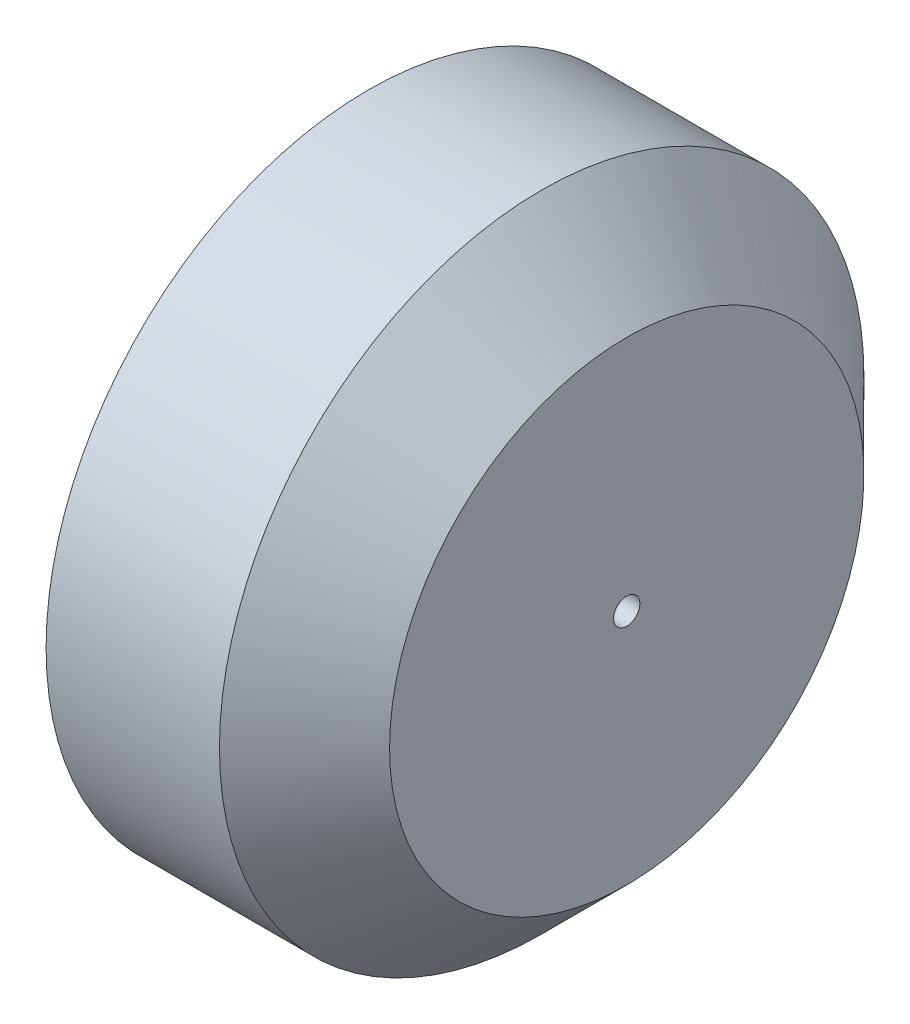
ISO-10303-21;
HEADER;
FILE_DESCRIPTION(('STEP AP214'),'2;1');
FILE_NAME('part.step','',(''),(''),'','','');
FILE_SCHEMA(('AUTOMOTIVE_DESIGN { 1 0 10303 214 1 1 1 1 }'));
ENDSEC;
DATA;
#1=APPLICATION_CONTEXT('core data for automotive mechanical design processes');
#2=APPLICATION_PROTOCOL_DEFINITION('international standard','automotive_design',2000,#1);
#3=PRODUCT_CONTEXT('',#1,'mechanical');
#4=PRODUCT('Part','Part','',(#3));
#5=PRODUCT_RELATED_PRODUCT_CATEGORY('part','',(#4));
#6=PRODUCT_DEFINITION_FORMATION('','',#4);
#7=PRODUCT_DEFINITION_CONTEXT('part definition',#1,'design');
#8=PRODUCT_DEFINITION('design','',#6,#7);
#9=PRODUCT_DEFINITION_SHAPE('','',#8);
#10=(LENGTH_UNIT() NAMED_UNIT(*) SI_UNIT(.MILLI.,.METRE.));
#11=(NAMED_UNIT(*) PLANE_ANGLE_UNIT() SI_UNIT($,.RADIAN.));
#12=(NAMED_UNIT(*) SI_UNIT($,.STERADIAN.) SOLID_ANGLE_UNIT());
#13=UNCERTAINTY_MEASURE_WITH_UNIT(LENGTH_MEASURE(1.E-05),#10,'distance_accuracy_value','');
#14=(GEOMETRIC_REPRESENTATION_CONTEXT(3) GLOBAL_UNCERTAINTY_ASSIGNED_CONTEXT((#13)) GLOBAL_UNIT_ASSIGNED_CONTEXT((#10,
#11,#12)) REPRESENTATION_CONTEXT('',''));
#15=CARTESIAN_POINT('',(0.,0.,0.));
#16=DIRECTION('',(0.,0.,1.));
#17=DIRECTION('',(1.,0.,0.));
#18=AXIS2_PLACEMENT_3D('',#15,#16,#17);
#19=CARTESIAN_POINT('',(738.,0.,-15.9));
#20=DIRECTION('',(-1.,0.,0.));
#21=DIRECTION('',(0.,0.,1.));
#22=AXIS2_PLACEMENT_3D('',#19,#20,#21);
#23=PLANE('',#22);
#24=CARTESIAN_POINT('',(738.,0.,-15.9));
#25=DIRECTION('',(-1.,0.,0.));
#26=DIRECTION('',(0.,0.,1.));
#27=AXIS2_PLACEMENT_3D('',#24,#25,#26);
#28=CIRCLE('',#27,72.5);
#29=CARTESIAN_POINT('',(738.,0.,56.6));
#30=VERTEX_POINT('',#29);
#31=EDGE_CURVE('E18',#30,#30,#28,.T.);
#32=ORIENTED_EDGE('',*,*,#31,.F.);
#33=EDGE_LOOP('',(#32));
#34=FACE_BOUND('',#33,.T.);
#35=CARTESIAN_POINT('',(738.,0.,-15.9));
#36=DIRECTION('',(1.,0.,0.));
#37=DIRECTION('',(0.,0.,-1.));
#38=AXIS2_PLACEMENT_3D('',#35,#36,#37);
#39=CIRCLE('',#38,4.);
#40=CARTESIAN_POINT('',(738.,0.,-19.9));
#41=VERTEX_POINT('',#40);
#42=EDGE_CURVE('E30',#41,#41,#39,.F.);
#43=ORIENTED_EDGE('',*,*,#42,.T.);
#44=EDGE_LOOP('',(#43));
#45=FACE_BOUND('',#44,.T.);
#46=ADVANCED_FACE('F14',(#34,#45),#23,.F.);
#47=CARTESIAN_POINT('',(712.,0.,-15.9));
#48=DIRECTION('',(-1.,0.,0.));
#49=DIRECTION('',(0.,0.,1.));
#50=AXIS2_PLACEMENT_3D('',#47,#48,#49);
#51=CONICAL_SURFACE('',#50,98.5,0.785398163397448);
#52=CARTESIAN_POINT('',(712.,0.,-15.9));
#53=DIRECTION('',(1.,0.,0.));
#54=DIRECTION('',(0.,0.,-1.));
#55=AXIS2_PLACEMENT_3D('',#52,#53,#54);
#56=CIRCLE('',#55,98.5);
#57=CARTESIAN_POINT('',(712.,0.,-114.4));
#58=VERTEX_POINT('',#57);
#59=EDGE_CURVE('E27',#58,#58,#56,.F.);
#60=ORIENTED_EDGE('',*,*,#59,.F.);
#61=EDGE_LOOP('',(#60));
#62=FACE_BOUND('',#61,.T.);
#63=ORIENTED_EDGE('',*,*,#31,.T.);
#64=EDGE_LOOP('',(#63));
#65=FACE_BOUND('',#64,.T.);
#66=ADVANCED_FACE('F38',(#62,#65),#51,.T.);
#67=CARTESIAN_POINT('',(698.5,0.,-15.9000000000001));
#68=DIRECTION('',(1.,0.,0.));
#69=DIRECTION('',(0.,0.,-1.));
#70=AXIS2_PLACEMENT_3D('',#67,#68,#69);
#71=CYLINDRICAL_SURFACE('',#70,4.);
#72=CARTESIAN_POINT('',(659.,0.,-15.9000000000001));
#73=DIRECTION('',(1.,0.,0.));
#74=DIRECTION('',(0.,0.,-1.));
#75=AXIS2_PLACEMENT_3D('',#72,#73,#74);
#76=CIRCLE('',#75,4.);
#77=CARTESIAN_POINT('',(659.,0.,-19.9000000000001));
#78=VERTEX_POINT('',#77);
#79=EDGE_CURVE('E22',#78,#78,#76,.T.);
#80=ORIENTED_EDGE('',*,*,#79,.F.);
#81=EDGE_LOOP('',(#80));
#82=FACE_BOUND('',#81,.T.);
#83=ORIENTED_EDGE('',*,*,#42,.F.);
#84=EDGE_LOOP('',(#83));
#85=FACE_BOUND('',#84,.T.);
#86=ADVANCED_FACE('F46',(#82,#85),#71,.F.);
#87=CARTESIAN_POINT('',(685.5,0.,-15.9000000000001));
#88=DIRECTION('',(1.,0.,0.));
#89=DIRECTION('',(0.,0.,-1.));
#90=AXIS2_PLACEMENT_3D('',#87,#88,#89);
#91=CYLINDRICAL_SURFACE('',#90,98.5);
#92=CARTESIAN_POINT('',(659.,0.,-15.9000000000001));
#93=DIRECTION('',(1.,0.,0.));
#94=DIRECTION('',(0.,0.,-1.));
#95=AXIS2_PLACEMENT_3D('',#92,#93,#94);
#96=CIRCLE('',#95,98.5);
#97=CARTESIAN_POINT('',(659.,0.,-114.4));
#98=VERTEX_POINT('',#97);
#99=EDGE_CURVE('E10',#98,#98,#96,.F.);
#100=ORIENTED_EDGE('',*,*,#99,.F.);
#101=EDGE_LOOP('',(#100));
#102=FACE_BOUND('',#101,.T.);
#103=ORIENTED_EDGE('',*,*,#59,.T.);
#104=EDGE_LOOP('',(#103));
#105=FACE_BOUND('',#104,.T.);
#106=ADVANCED_FACE('F50',(#102,#105),#91,.T.);
#107=CARTESIAN_POINT('',(659.,0.,-15.9000000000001));
#108=DIRECTION('',(-1.,0.,0.));
#109=DIRECTION('',(0.,0.,1.));
#110=AXIS2_PLACEMENT_3D('',#107,#108,#109);
#111=PLANE('',#110);
#112=ORIENTED_EDGE('',*,*,#99,.T.);
#113=EDGE_LOOP('',(#112));
#114=FACE_BOUND('',#113,.T.);
#115=ORIENTED_EDGE('',*,*,#79,.T.);
#116=EDGE_LOOP('',(#115));
#117=FACE_BOUND('',#116,.T.);
#118=ADVANCED_FACE('F16',(#114,#117),#111,.T.);
#119=CLOSED_SHELL('',(#46,#66,#86,#106,#118));
#120=MANIFOLD_SOLID_BREP('B1',#119);
#121=ADVANCED_BREP_SHAPE_REPRESENTATION('',(#18,#120),#14);
#122=SHAPE_DEFINITION_REPRESENTATION(#9,#121);
ENDSEC;
END-ISO-10303-21;
